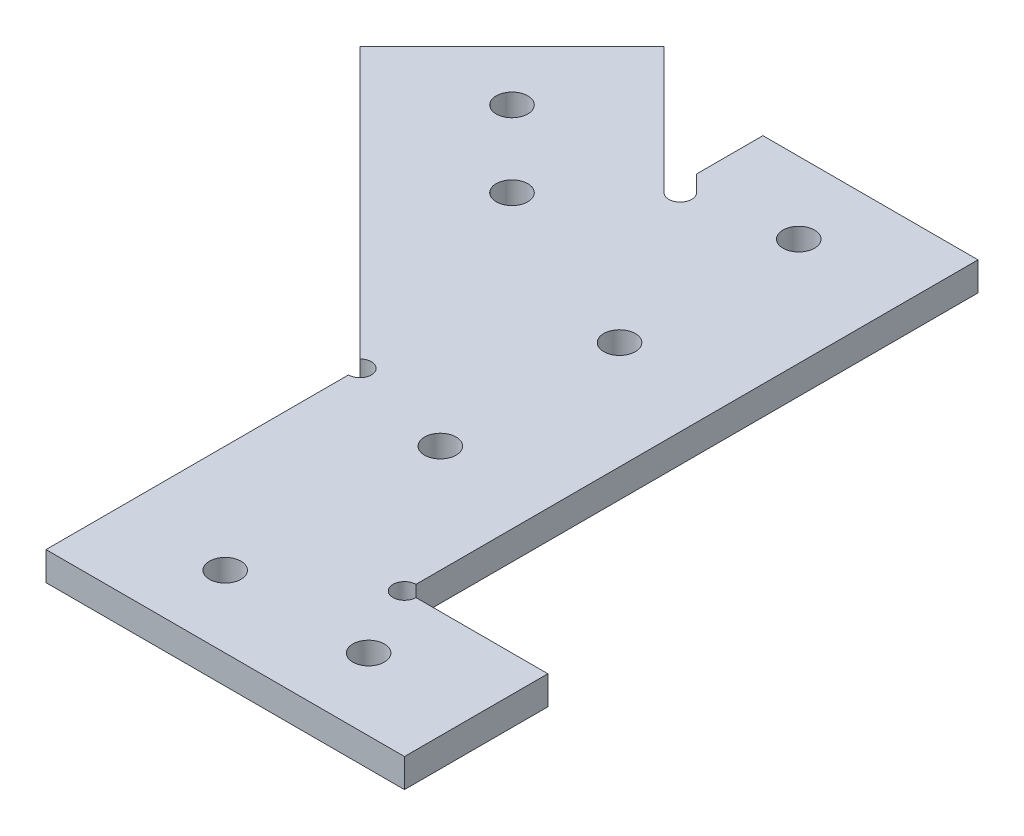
ISO-10303-21;
HEADER;
FILE_DESCRIPTION(('STEP AP214'),'2;1');
FILE_NAME('part.step','',(''),(''),'','','');
FILE_SCHEMA(('AUTOMOTIVE_DESIGN { 1 0 10303 214 1 1 1 1 }'));
ENDSEC;
DATA;
#1=APPLICATION_CONTEXT('core data for automotive mechanical design processes');
#2=APPLICATION_PROTOCOL_DEFINITION('international standard','automotive_design',2000,#1);
#3=PRODUCT_CONTEXT('',#1,'mechanical');
#4=PRODUCT('Part','Part','',(#3));
#5=PRODUCT_RELATED_PRODUCT_CATEGORY('part','',(#4));
#6=PRODUCT_DEFINITION_FORMATION('','',#4);
#7=PRODUCT_DEFINITION_CONTEXT('part definition',#1,'design');
#8=PRODUCT_DEFINITION('design','',#6,#7);
#9=PRODUCT_DEFINITION_SHAPE('','',#8);
#10=(LENGTH_UNIT() NAMED_UNIT(*) SI_UNIT(.MILLI.,.METRE.));
#11=(NAMED_UNIT(*) PLANE_ANGLE_UNIT() SI_UNIT($,.RADIAN.));
#12=(NAMED_UNIT(*) SI_UNIT($,.STERADIAN.) SOLID_ANGLE_UNIT());
#13=UNCERTAINTY_MEASURE_WITH_UNIT(LENGTH_MEASURE(1.E-05),#10,'distance_accuracy_value','');
#14=(GEOMETRIC_REPRESENTATION_CONTEXT(3) GLOBAL_UNCERTAINTY_ASSIGNED_CONTEXT((#13)) GLOBAL_UNIT_ASSIGNED_CONTEXT((#10,
#11,#12)) REPRESENTATION_CONTEXT('',''));
#15=CARTESIAN_POINT('',(0.,0.,0.));
#16=DIRECTION('',(0.,0.,1.));
#17=DIRECTION('',(1.,0.,0.));
#18=AXIS2_PLACEMENT_3D('',#15,#16,#17);
#19=CARTESIAN_POINT('',(35.3611682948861,0.,-35.3611682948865));
#20=DIRECTION('',(0.707106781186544,0.,-0.707106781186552));
#21=DIRECTION('',(0.,-1.,0.));
#22=AXIS2_PLACEMENT_3D('',#19,#20,#21);
#23=PLANE('',#22);
#24=DIRECTION('',(-0.707106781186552,0.,-0.707106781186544));
#25=VECTOR('',#24,1.);
#26=CARTESIAN_POINT('',(35.3611682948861,4.,-35.3611682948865));
#27=LINE('',#26,#25);
#28=CARTESIAN_POINT('',(2.11880443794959,4.,-68.6035321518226));
#29=VERTEX_POINT('',#28);
#30=CARTESIAN_POINT('',(0.,4.,-70.7223365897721));
#31=VERTEX_POINT('',#30);
#32=EDGE_CURVE('E142',#29,#31,#27,.T.);
#33=ORIENTED_EDGE('',*,*,#32,.T.);
#34=DIRECTION('',(0.,1.,0.));
#35=VECTOR('',#34,1.);
#36=CARTESIAN_POINT('',(0.,0.,-70.7223365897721));
#37=LINE('',#36,#35);
#38=CARTESIAN_POINT('',(0.,0.,-70.7223365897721));
#39=VERTEX_POINT('',#38);
#40=EDGE_CURVE('E184',#39,#31,#37,.T.);
#41=ORIENTED_EDGE('',*,*,#40,.F.);
#42=DIRECTION('',(-0.707106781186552,0.,-0.707106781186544));
#43=VECTOR('',#42,1.);
#44=CARTESIAN_POINT('',(35.3611682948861,0.,-35.3611682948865));
#45=LINE('',#44,#43);
#46=CARTESIAN_POINT('',(2.11880443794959,0.,-68.6035321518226));
#47=VERTEX_POINT('',#46);
#48=EDGE_CURVE('E11',#47,#39,#45,.T.);
#49=ORIENTED_EDGE('',*,*,#48,.F.);
#50=DIRECTION('',(0.,1.,0.));
#51=VECTOR('',#50,1.);
#52=CARTESIAN_POINT('',(2.11880443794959,0.,-68.6035321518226));
#53=LINE('',#52,#51);
#54=EDGE_CURVE('E338',#47,#29,#53,.T.);
#55=ORIENTED_EDGE('',*,*,#54,.T.);
#56=EDGE_LOOP('',(#33,#41,#49,#55));
#57=FACE_BOUND('',#56,.T.);
#58=ADVANCED_FACE('F17',(#57),#23,.F.);
#59=CARTESIAN_POINT('',(0.,0.,-23.7867965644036));
#60=DIRECTION('',(0.,1.,0.));
#61=DIRECTION('',(0.,0.,1.));
#62=AXIS2_PLACEMENT_3D('',#59,#60,#61);
#63=CYLINDRICAL_SURFACE('',#62,1.6);
#64=DIRECTION('',(0.,1.,0.));
#65=VECTOR('',#64,1.);
#66=CARTESIAN_POINT('',(0.,0.,-22.1867965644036));
#67=LINE('',#66,#65);
#68=CARTESIAN_POINT('',(0.,0.,-22.1867965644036));
#69=VERTEX_POINT('',#68);
#70=CARTESIAN_POINT('',(0.,4.,-22.1867965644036));
#71=VERTEX_POINT('',#70);
#72=EDGE_CURVE('E266',#69,#71,#67,.T.);
#73=ORIENTED_EDGE('',*,*,#72,.T.);
#74=CARTESIAN_POINT('',(0.,4.,-23.7867965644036));
#75=DIRECTION('',(0.,1.,0.));
#76=DIRECTION('',(0.,0.,1.));
#77=AXIS2_PLACEMENT_3D('',#74,#75,#76);
#78=CIRCLE('',#77,1.6);
#79=CARTESIAN_POINT('',(-1.13137084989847,4.,-24.918167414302));
#80=VERTEX_POINT('',#79);
#81=EDGE_CURVE('E39',#71,#80,#78,.T.);
#82=ORIENTED_EDGE('',*,*,#81,.T.);
#83=DIRECTION('',(0.,1.,0.));
#84=VECTOR('',#83,1.);
#85=CARTESIAN_POINT('',(-1.13137084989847,0.,-24.918167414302));
#86=LINE('',#85,#84);
#87=CARTESIAN_POINT('',(-1.13137084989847,0.,-24.918167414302));
#88=VERTEX_POINT('',#87);
#89=EDGE_CURVE('E139',#88,#80,#86,.T.);
#90=ORIENTED_EDGE('',*,*,#89,.F.);
#91=CARTESIAN_POINT('',(0.,0.,-23.7867965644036));
#92=DIRECTION('',(0.,1.,0.));
#93=DIRECTION('',(0.,0.,1.));
#94=AXIS2_PLACEMENT_3D('',#91,#92,#93);
#95=CIRCLE('',#94,1.6);
#96=EDGE_CURVE('E26',#69,#88,#95,.T.);
#97=ORIENTED_EDGE('',*,*,#96,.F.);
#98=EDGE_LOOP('',(#73,#82,#90,#97));
#99=FACE_BOUND('',#98,.T.);
#100=ADVANCED_FACE('F922',(#99),#63,.F.);
#101=CARTESIAN_POINT('',(0.,0.,0.));
#102=DIRECTION('',(0.,1.,0.));
#103=DIRECTION('',(1.,0.,0.));
#104=AXIS2_PLACEMENT_3D('',#101,#102,#103);
#105=PLANE('',#104);
#106=CARTESIAN_POINT('',(15.,0.,10.));
#107=DIRECTION('',(0.,1.,0.));
#108=DIRECTION('',(0.,0.,1.));
#109=AXIS2_PLACEMENT_3D('',#106,#107,#108);
#110=CIRCLE('',#109,2.2);
#111=CARTESIAN_POINT('',(15.,0.,12.2));
#112=VERTEX_POINT('',#111);
#113=EDGE_CURVE('E320',#112,#112,#110,.T.);
#114=ORIENTED_EDGE('',*,*,#113,.T.);
#115=EDGE_LOOP('',(#114));
#116=FACE_BOUND('',#115,.T.);
#117=CARTESIAN_POINT('',(35.,0.,10.));
#118=DIRECTION('',(0.,1.,0.));
#119=DIRECTION('',(0.,0.,1.));
#120=AXIS2_PLACEMENT_3D('',#117,#118,#119);
#121=CIRCLE('',#120,2.2);
#122=CARTESIAN_POINT('',(35.,0.,12.2));
#123=VERTEX_POINT('',#122);
#124=EDGE_CURVE('E262',#123,#123,#121,.T.);
#125=ORIENTED_EDGE('',*,*,#124,.T.);
#126=EDGE_LOOP('',(#125));
#127=FACE_BOUND('',#126,.T.);
#128=CARTESIAN_POINT('',(15.,0.,-70.));
#129=DIRECTION('',(0.,1.,0.));
#130=DIRECTION('',(0.,0.,1.));
#131=AXIS2_PLACEMENT_3D('',#128,#129,#130);
#132=CIRCLE('',#131,2.2);
#133=CARTESIAN_POINT('',(15.,0.,-67.8));
#134=VERTEX_POINT('',#133);
#135=EDGE_CURVE('E242',#134,#134,#132,.T.);
#136=ORIENTED_EDGE('',*,*,#135,.T.);
#137=EDGE_LOOP('',(#136));
#138=FACE_BOUND('',#137,.T.);
#139=CARTESIAN_POINT('',(15.,0.,-45.));
#140=DIRECTION('',(0.,1.,0.));
#141=DIRECTION('',(0.,0.,1.));
#142=AXIS2_PLACEMENT_3D('',#139,#140,#141);
#143=CIRCLE('',#142,2.2);
#144=CARTESIAN_POINT('',(15.,0.,-42.8));
#145=VERTEX_POINT('',#144);
#146=EDGE_CURVE('E234',#145,#145,#143,.T.);
#147=ORIENTED_EDGE('',*,*,#146,.T.);
#148=EDGE_LOOP('',(#147));
#149=FACE_BOUND('',#148,.T.);
#150=CARTESIAN_POINT('',(15.,0.,-20.));
#151=DIRECTION('',(0.,1.,0.));
#152=DIRECTION('',(0.,0.,1.));
#153=AXIS2_PLACEMENT_3D('',#150,#151,#152);
#154=CIRCLE('',#153,2.2);
#155=CARTESIAN_POINT('',(15.,0.,-17.8));
#156=VERTEX_POINT('',#155);
#157=EDGE_CURVE('E221',#156,#156,#154,.T.);
#158=ORIENTED_EDGE('',*,*,#157,.T.);
#159=EDGE_LOOP('',(#158));
#160=FACE_BOUND('',#159,.T.);
#161=CARTESIAN_POINT('',(-10.6066017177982,0.,-55.6066017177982));
#162=DIRECTION('',(0.,1.,0.));
#163=DIRECTION('',(0.,0.,1.));
#164=AXIS2_PLACEMENT_3D('',#161,#162,#163);
#165=CIRCLE('',#164,2.2);
#166=CARTESIAN_POINT('',(-10.6066017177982,0.,-53.4066017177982));
#167=VERTEX_POINT('',#166);
#168=EDGE_CURVE('E222',#167,#167,#165,.T.);
#169=ORIENTED_EDGE('',*,*,#168,.T.);
#170=EDGE_LOOP('',(#169));
#171=FACE_BOUND('',#170,.T.);
#172=CARTESIAN_POINT('',(-21.2132034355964,0.,-66.2132034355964));
#173=DIRECTION('',(0.,1.,0.));
#174=DIRECTION('',(0.,0.,1.));
#175=AXIS2_PLACEMENT_3D('',#172,#173,#174);
#176=CIRCLE('',#175,2.2);
#177=CARTESIAN_POINT('',(-21.2132034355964,0.,-64.0132034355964));
#178=VERTEX_POINT('',#177);
#179=EDGE_CURVE('E319',#178,#178,#176,.T.);
#180=ORIENTED_EDGE('',*,*,#179,.T.);
#181=EDGE_LOOP('',(#180));
#182=FACE_BOUND('',#181,.T.);
#183=DIRECTION('',(0.,0.,-1.));
#184=VECTOR('',#183,1.);
#185=CARTESIAN_POINT('',(30.,0.,0.));
#186=LINE('',#185,#184);
#187=CARTESIAN_POINT('',(30.,0.,-1.6));
#188=VERTEX_POINT('',#187);
#189=CARTESIAN_POINT('',(30.,0.,-80.));
#190=VERTEX_POINT('',#189);
#191=EDGE_CURVE('E291',#188,#190,#186,.T.);
#192=ORIENTED_EDGE('',*,*,#191,.F.);
#193=CARTESIAN_POINT('',(30.,0.,0.));
#194=DIRECTION('',(0.,1.,0.));
#195=DIRECTION('',(0.,0.,1.));
#196=AXIS2_PLACEMENT_3D('',#193,#194,#195);
#197=CIRCLE('',#196,1.6);
#198=CARTESIAN_POINT('',(31.6,0.,0.));
#199=VERTEX_POINT('',#198);
#200=EDGE_CURVE('E361',#188,#199,#197,.T.);
#201=ORIENTED_EDGE('',*,*,#200,.T.);
#202=DIRECTION('',(-1.,0.,0.));
#203=VECTOR('',#202,1.);
#204=CARTESIAN_POINT('',(0.,0.,0.));
#205=LINE('',#204,#203);
#206=CARTESIAN_POINT('',(50.,0.,0.));
#207=VERTEX_POINT('',#206);
#208=EDGE_CURVE('E284',#207,#199,#205,.T.);
#209=ORIENTED_EDGE('',*,*,#208,.F.);
#210=DIRECTION('',(0.,0.,-1.));
#211=VECTOR('',#210,1.);
#212=CARTESIAN_POINT('',(50.,0.,0.));
#213=LINE('',#212,#211);
#214=CARTESIAN_POINT('',(50.,0.,20.));
#215=VERTEX_POINT('',#214);
#216=EDGE_CURVE('E272',#215,#207,#213,.T.);
#217=ORIENTED_EDGE('',*,*,#216,.F.);
#218=DIRECTION('',(1.,0.,0.));
#219=VECTOR('',#218,1.);
#220=CARTESIAN_POINT('',(0.,0.,20.));
#221=LINE('',#220,#219);
#222=CARTESIAN_POINT('',(0.,0.,20.));
#223=VERTEX_POINT('',#222);
#224=EDGE_CURVE('E252',#223,#215,#221,.T.);
#225=ORIENTED_EDGE('',*,*,#224,.F.);
#226=DIRECTION('',(0.,0.,-1.));
#227=VECTOR('',#226,1.);
#228=CARTESIAN_POINT('',(0.,0.,0.));
#229=LINE('',#228,#227);
#230=EDGE_CURVE('E258',#223,#69,#229,.T.);
#231=ORIENTED_EDGE('',*,*,#230,.T.);
#232=ORIENTED_EDGE('',*,*,#96,.T.);
#233=DIRECTION('',(0.707106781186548,0.,0.707106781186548));
#234=VECTOR('',#233,1.);
#235=CARTESIAN_POINT('',(11.8933982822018,0.,-11.8933982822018));
#236=LINE('',#235,#234);
#237=CARTESIAN_POINT('',(-38.8908729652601,0.,-62.6776695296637));
#238=VERTEX_POINT('',#237);
#239=EDGE_CURVE('E154',#238,#88,#236,.T.);
#240=ORIENTED_EDGE('',*,*,#239,.F.);
#241=DIRECTION('',(-0.707106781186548,0.,0.707106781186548));
#242=VECTOR('',#241,1.);
#243=CARTESIAN_POINT('',(-50.7842712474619,0.,-50.7842712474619));
#244=LINE('',#243,#242);
#245=CARTESIAN_POINT('',(-17.6776695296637,0.,-83.8908729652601));
#246=VERTEX_POINT('',#245);
#247=EDGE_CURVE('E157',#246,#238,#244,.T.);
#248=ORIENTED_EDGE('',*,*,#247,.F.);
#249=DIRECTION('',(-0.707106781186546,0.,-0.707106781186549));
#250=VECTOR('',#249,1.);
#251=CARTESIAN_POINT('',(33.1066017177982,0.,-33.106601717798));
#252=LINE('',#251,#250);
#253=CARTESIAN_POINT('',(0.,0.,-66.2132034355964));
#254=VERTEX_POINT('',#253);
#255=EDGE_CURVE('E191',#254,#246,#252,.T.);
#256=ORIENTED_EDGE('',*,*,#255,.F.);
#257=CARTESIAN_POINT('',(1.13137084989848,0.,-67.3445742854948));
#258=DIRECTION('',(0.,1.,0.));
#259=DIRECTION('',(0.,0.,1.));
#260=AXIS2_PLACEMENT_3D('',#257,#258,#259);
#261=CIRCLE('',#260,1.6);
#262=EDGE_CURVE('E352',#254,#47,#261,.T.);
#263=ORIENTED_EDGE('',*,*,#262,.T.);
#264=ORIENTED_EDGE('',*,*,#48,.T.);
#265=DIRECTION('',(0.,0.,-1.));
#266=VECTOR('',#265,1.);
#267=CARTESIAN_POINT('',(0.,0.,0.));
#268=LINE('',#267,#266);
#269=CARTESIAN_POINT('',(0.,0.,-80.));
#270=VERTEX_POINT('',#269);
#271=EDGE_CURVE('E188',#39,#270,#268,.T.);
#272=ORIENTED_EDGE('',*,*,#271,.T.);
#273=DIRECTION('',(1.,0.,0.));
#274=VECTOR('',#273,1.);
#275=CARTESIAN_POINT('',(0.,0.,-80.));
#276=LINE('',#275,#274);
#277=EDGE_CURVE('E170',#270,#190,#276,.T.);
#278=ORIENTED_EDGE('',*,*,#277,.T.);
#279=EDGE_LOOP('',(#192,#201,#209,#217,#225,#231,#232,#240,#248,#256,#263,#264,#272,#278));
#280=FACE_BOUND('',#279,.T.);
#281=ADVANCED_FACE('F385',(#116,#127,#138,#149,#160,#171,#182,#280),#105,.F.);
#282=CARTESIAN_POINT('',(0.,4.,0.));
#283=DIRECTION('',(0.,1.,0.));
#284=DIRECTION('',(1.,0.,0.));
#285=AXIS2_PLACEMENT_3D('',#282,#283,#284);
#286=PLANE('',#285);
#287=CARTESIAN_POINT('',(15.,4.,10.));
#288=DIRECTION('',(0.,1.,0.));
#289=DIRECTION('',(0.,0.,1.));
#290=AXIS2_PLACEMENT_3D('',#287,#288,#289);
#291=CIRCLE('',#290,2.2);
#292=CARTESIAN_POINT('',(15.,4.,12.2));
#293=VERTEX_POINT('',#292);
#294=EDGE_CURVE('E330',#293,#293,#291,.T.);
#295=ORIENTED_EDGE('',*,*,#294,.F.);
#296=EDGE_LOOP('',(#295));
#297=FACE_BOUND('',#296,.T.);
#298=CARTESIAN_POINT('',(35.,4.,10.));
#299=DIRECTION('',(0.,1.,0.));
#300=DIRECTION('',(0.,0.,1.));
#301=AXIS2_PLACEMENT_3D('',#298,#299,#300);
#302=CIRCLE('',#301,2.2);
#303=CARTESIAN_POINT('',(35.,4.,12.2));
#304=VERTEX_POINT('',#303);
#305=EDGE_CURVE('E246',#304,#304,#302,.T.);
#306=ORIENTED_EDGE('',*,*,#305,.F.);
#307=EDGE_LOOP('',(#306));
#308=FACE_BOUND('',#307,.T.);
#309=CARTESIAN_POINT('',(15.,4.,-70.));
#310=DIRECTION('',(0.,1.,0.));
#311=DIRECTION('',(0.,0.,1.));
#312=AXIS2_PLACEMENT_3D('',#309,#310,#311);
#313=CIRCLE('',#312,2.2);
#314=CARTESIAN_POINT('',(15.,4.,-67.8));
#315=VERTEX_POINT('',#314);
#316=EDGE_CURVE('E238',#315,#315,#313,.T.);
#317=ORIENTED_EDGE('',*,*,#316,.F.);
#318=EDGE_LOOP('',(#317));
#319=FACE_BOUND('',#318,.T.);
#320=CARTESIAN_POINT('',(15.,4.,-45.));
#321=DIRECTION('',(0.,1.,0.));
#322=DIRECTION('',(0.,0.,1.));
#323=AXIS2_PLACEMENT_3D('',#320,#321,#322);
#324=CIRCLE('',#323,2.2);
#325=CARTESIAN_POINT('',(15.,4.,-42.8));
#326=VERTEX_POINT('',#325);
#327=EDGE_CURVE('E228',#326,#326,#324,.T.);
#328=ORIENTED_EDGE('',*,*,#327,.F.);
#329=EDGE_LOOP('',(#328));
#330=FACE_BOUND('',#329,.T.);
#331=CARTESIAN_POINT('',(15.,4.,-20.));
#332=DIRECTION('',(0.,1.,0.));
#333=DIRECTION('',(0.,0.,1.));
#334=AXIS2_PLACEMENT_3D('',#331,#332,#333);
#335=CIRCLE('',#334,2.2);
#336=CARTESIAN_POINT('',(15.,4.,-17.8));
#337=VERTEX_POINT('',#336);
#338=EDGE_CURVE('E217',#337,#337,#335,.T.);
#339=ORIENTED_EDGE('',*,*,#338,.F.);
#340=EDGE_LOOP('',(#339));
#341=FACE_BOUND('',#340,.T.);
#342=CARTESIAN_POINT('',(-10.6066017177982,4.,-55.6066017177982));
#343=DIRECTION('',(0.,1.,0.));
#344=DIRECTION('',(0.,0.,1.));
#345=AXIS2_PLACEMENT_3D('',#342,#343,#344);
#346=CIRCLE('',#345,2.2);
#347=CARTESIAN_POINT('',(-10.6066017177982,4.,-53.4066017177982));
#348=VERTEX_POINT('',#347);
#349=EDGE_CURVE('E215',#348,#348,#346,.T.);
#350=ORIENTED_EDGE('',*,*,#349,.F.);
#351=EDGE_LOOP('',(#350));
#352=FACE_BOUND('',#351,.T.);
#353=CARTESIAN_POINT('',(-21.2132034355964,4.,-66.2132034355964));
#354=DIRECTION('',(0.,1.,0.));
#355=DIRECTION('',(0.,0.,1.));
#356=AXIS2_PLACEMENT_3D('',#353,#354,#355);
#357=CIRCLE('',#356,2.2);
#358=CARTESIAN_POINT('',(-21.2132034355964,4.,-64.0132034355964));
#359=VERTEX_POINT('',#358);
#360=EDGE_CURVE('E316',#359,#359,#357,.T.);
#361=ORIENTED_EDGE('',*,*,#360,.F.);
#362=EDGE_LOOP('',(#361));
#363=FACE_BOUND('',#362,.T.);
#364=CARTESIAN_POINT('',(30.,4.,0.));
#365=DIRECTION('',(0.,1.,0.));
#366=DIRECTION('',(0.,0.,1.));
#367=AXIS2_PLACEMENT_3D('',#364,#365,#366);
#368=CIRCLE('',#367,1.6);
#369=CARTESIAN_POINT('',(30.,4.,-1.6));
#370=VERTEX_POINT('',#369);
#371=CARTESIAN_POINT('',(31.6,4.,0.));
#372=VERTEX_POINT('',#371);
#373=EDGE_CURVE('E370',#370,#372,#368,.T.);
#374=ORIENTED_EDGE('',*,*,#373,.F.);
#375=DIRECTION('',(0.,0.,-1.));
#376=VECTOR('',#375,1.);
#377=CARTESIAN_POINT('',(30.,4.,0.));
#378=LINE('',#377,#376);
#379=CARTESIAN_POINT('',(30.,4.,-80.));
#380=VERTEX_POINT('',#379);
#381=EDGE_CURVE('E294',#370,#380,#378,.T.);
#382=ORIENTED_EDGE('',*,*,#381,.T.);
#383=DIRECTION('',(1.,0.,0.));
#384=VECTOR('',#383,1.);
#385=CARTESIAN_POINT('',(0.,4.,-80.));
#386=LINE('',#385,#384);
#387=CARTESIAN_POINT('',(0.,4.,-80.));
#388=VERTEX_POINT('',#387);
#389=EDGE_CURVE('E178',#388,#380,#386,.T.);
#390=ORIENTED_EDGE('',*,*,#389,.F.);
#391=DIRECTION('',(0.,0.,-1.));
#392=VECTOR('',#391,1.);
#393=CARTESIAN_POINT('',(0.,4.,0.));
#394=LINE('',#393,#392);
#395=EDGE_CURVE('E185',#31,#388,#394,.T.);
#396=ORIENTED_EDGE('',*,*,#395,.F.);
#397=ORIENTED_EDGE('',*,*,#32,.F.);
#398=CARTESIAN_POINT('',(1.13137084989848,4.,-67.3445742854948));
#399=DIRECTION('',(0.,1.,0.));
#400=DIRECTION('',(0.,0.,1.));
#401=AXIS2_PLACEMENT_3D('',#398,#399,#400);
#402=CIRCLE('',#401,1.6);
#403=CARTESIAN_POINT('',(0.,4.,-66.2132034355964));
#404=VERTEX_POINT('',#403);
#405=EDGE_CURVE('E343',#404,#29,#402,.T.);
#406=ORIENTED_EDGE('',*,*,#405,.F.);
#407=DIRECTION('',(-0.707106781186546,0.,-0.707106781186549));
#408=VECTOR('',#407,1.);
#409=CARTESIAN_POINT('',(33.1066017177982,4.,-33.106601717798));
#410=LINE('',#409,#408);
#411=CARTESIAN_POINT('',(-17.6776695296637,4.,-83.8908729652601));
#412=VERTEX_POINT('',#411);
#413=EDGE_CURVE('E149',#404,#412,#410,.T.);
#414=ORIENTED_EDGE('',*,*,#413,.T.);
#415=DIRECTION('',(-0.707106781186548,0.,0.707106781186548));
#416=VECTOR('',#415,1.);
#417=CARTESIAN_POINT('',(-50.7842712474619,4.,-50.7842712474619));
#418=LINE('',#417,#416);
#419=CARTESIAN_POINT('',(-38.8908729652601,4.,-62.6776695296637));
#420=VERTEX_POINT('',#419);
#421=EDGE_CURVE('E146',#412,#420,#418,.T.);
#422=ORIENTED_EDGE('',*,*,#421,.T.);
#423=DIRECTION('',(0.707106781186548,0.,0.707106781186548));
#424=VECTOR('',#423,1.);
#425=CARTESIAN_POINT('',(11.8933982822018,4.,-11.8933982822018));
#426=LINE('',#425,#424);
#427=EDGE_CURVE('E132',#420,#80,#426,.T.);
#428=ORIENTED_EDGE('',*,*,#427,.T.);
#429=ORIENTED_EDGE('',*,*,#81,.F.);
#430=DIRECTION('',(0.,0.,-1.));
#431=VECTOR('',#430,1.);
#432=CARTESIAN_POINT('',(0.,4.,0.));
#433=LINE('',#432,#431);
#434=CARTESIAN_POINT('',(0.,4.,20.));
#435=VERTEX_POINT('',#434);
#436=EDGE_CURVE('E257',#435,#71,#433,.T.);
#437=ORIENTED_EDGE('',*,*,#436,.F.);
#438=DIRECTION('',(1.,0.,0.));
#439=VECTOR('',#438,1.);
#440=CARTESIAN_POINT('',(0.,4.,20.));
#441=LINE('',#440,#439);
#442=CARTESIAN_POINT('',(50.,4.,20.));
#443=VERTEX_POINT('',#442);
#444=EDGE_CURVE('E251',#435,#443,#441,.T.);
#445=ORIENTED_EDGE('',*,*,#444,.T.);
#446=DIRECTION('',(0.,0.,-1.));
#447=VECTOR('',#446,1.);
#448=CARTESIAN_POINT('',(50.,4.,0.));
#449=LINE('',#448,#447);
#450=CARTESIAN_POINT('',(50.,4.,0.));
#451=VERTEX_POINT('',#450);
#452=EDGE_CURVE('E280',#443,#451,#449,.T.);
#453=ORIENTED_EDGE('',*,*,#452,.T.);
#454=DIRECTION('',(-1.,0.,0.));
#455=VECTOR('',#454,1.);
#456=CARTESIAN_POINT('',(0.,4.,0.));
#457=LINE('',#456,#455);
#458=EDGE_CURVE('E288',#451,#372,#457,.T.);
#459=ORIENTED_EDGE('',*,*,#458,.T.);
#460=EDGE_LOOP('',(#374,#382,#390,#396,#397,#406,#414,#422,#428,#429,#437,#445,#453,#459));
#461=FACE_BOUND('',#460,.T.);
#462=ADVANCED_FACE('F147',(#297,#308,#319,#330,#341,#352,#363,#461),#286,.T.);
#463=CARTESIAN_POINT('',(11.8933982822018,4.,-11.8933982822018));
#464=DIRECTION('',(0.707106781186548,0.,-0.707106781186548));
#465=DIRECTION('',(0.,-1.,0.));
#466=AXIS2_PLACEMENT_3D('',#463,#464,#465);
#467=PLANE('',#466);
#468=ORIENTED_EDGE('',*,*,#239,.T.);
#469=ORIENTED_EDGE('',*,*,#89,.T.);
#470=ORIENTED_EDGE('',*,*,#427,.F.);
#471=DIRECTION('',(0.,-1.,0.));
#472=VECTOR('',#471,1.);
#473=CARTESIAN_POINT('',(-38.8908729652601,4.,-62.6776695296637));
#474=LINE('',#473,#472);
#475=EDGE_CURVE('E137',#420,#238,#474,.T.);
#476=ORIENTED_EDGE('',*,*,#475,.T.);
#477=EDGE_LOOP('',(#468,#469,#470,#476));
#478=FACE_BOUND('',#477,.T.);
#479=ADVANCED_FACE('F135',(#478),#467,.F.);
#480=CARTESIAN_POINT('',(-50.7842712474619,4.,-50.7842712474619));
#481=DIRECTION('',(0.707106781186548,0.,0.707106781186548));
#482=DIRECTION('',(0.,-1.,0.));
#483=AXIS2_PLACEMENT_3D('',#480,#481,#482);
#484=PLANE('',#483);
#485=ORIENTED_EDGE('',*,*,#247,.T.);
#486=ORIENTED_EDGE('',*,*,#475,.F.);
#487=ORIENTED_EDGE('',*,*,#421,.F.);
#488=DIRECTION('',(0.,-1.,0.));
#489=VECTOR('',#488,1.);
#490=CARTESIAN_POINT('',(-17.6776695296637,4.,-83.8908729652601));
#491=LINE('',#490,#489);
#492=EDGE_CURVE('E181',#412,#246,#491,.T.);
#493=ORIENTED_EDGE('',*,*,#492,.T.);
#494=EDGE_LOOP('',(#485,#486,#487,#493));
#495=FACE_BOUND('',#494,.T.);
#496=ADVANCED_FACE('F156',(#495),#484,.F.);
#497=CARTESIAN_POINT('',(33.1066017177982,4.,-33.106601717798));
#498=DIRECTION('',(-0.707106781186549,0.,0.707106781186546));
#499=DIRECTION('',(0.,1.,0.));
#500=AXIS2_PLACEMENT_3D('',#497,#498,#499);
#501=PLANE('',#500);
#502=ORIENTED_EDGE('',*,*,#255,.T.);
#503=ORIENTED_EDGE('',*,*,#492,.F.);
#504=ORIENTED_EDGE('',*,*,#413,.F.);
#505=DIRECTION('',(0.,-1.,0.));
#506=VECTOR('',#505,1.);
#507=CARTESIAN_POINT('',(0.,4.,-66.2132034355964));
#508=LINE('',#507,#506);
#509=EDGE_CURVE('E164',#404,#254,#508,.T.);
#510=ORIENTED_EDGE('',*,*,#509,.T.);
#511=EDGE_LOOP('',(#502,#503,#504,#510));
#512=FACE_BOUND('',#511,.T.);
#513=ADVANCED_FACE('F411',(#512),#501,.F.);
#514=CARTESIAN_POINT('',(0.,4.,0.));
#515=DIRECTION('',(-1.,0.,0.));
#516=DIRECTION('',(0.,0.,1.));
#517=AXIS2_PLACEMENT_3D('',#514,#515,#516);
#518=PLANE('',#517);
#519=ORIENTED_EDGE('',*,*,#40,.T.);
#520=ORIENTED_EDGE('',*,*,#395,.T.);
#521=DIRECTION('',(0.,-1.,0.));
#522=VECTOR('',#521,1.);
#523=CARTESIAN_POINT('',(0.,4.,-80.));
#524=LINE('',#523,#522);
#525=EDGE_CURVE('E173',#388,#270,#524,.T.);
#526=ORIENTED_EDGE('',*,*,#525,.T.);
#527=ORIENTED_EDGE('',*,*,#271,.F.);
#528=EDGE_LOOP('',(#519,#520,#526,#527));
#529=FACE_BOUND('',#528,.T.);
#530=ADVANCED_FACE('F407',(#529),#518,.T.);
#531=CARTESIAN_POINT('',(0.,4.,-80.));
#532=DIRECTION('',(0.,0.,-1.));
#533=DIRECTION('',(0.,-1.,0.));
#534=AXIS2_PLACEMENT_3D('',#531,#532,#533);
#535=PLANE('',#534);
#536=ORIENTED_EDGE('',*,*,#277,.F.);
#537=ORIENTED_EDGE('',*,*,#525,.F.);
#538=ORIENTED_EDGE('',*,*,#389,.T.);
#539=DIRECTION('',(0.,-1.,0.));
#540=VECTOR('',#539,1.);
#541=CARTESIAN_POINT('',(30.,4.,-80.));
#542=LINE('',#541,#540);
#543=EDGE_CURVE('E174',#380,#190,#542,.T.);
#544=ORIENTED_EDGE('',*,*,#543,.T.);
#545=EDGE_LOOP('',(#536,#537,#538,#544));
#546=FACE_BOUND('',#545,.T.);
#547=ADVANCED_FACE('F851',(#546),#535,.T.);
#548=CARTESIAN_POINT('',(30.,4.,0.));
#549=DIRECTION('',(-1.,0.,0.));
#550=DIRECTION('',(0.,0.,1.));
#551=AXIS2_PLACEMENT_3D('',#548,#549,#550);
#552=PLANE('',#551);
#553=ORIENTED_EDGE('',*,*,#381,.F.);
#554=DIRECTION('',(0.,1.,0.));
#555=VECTOR('',#554,1.);
#556=CARTESIAN_POINT('',(30.,0.,-1.6));
#557=LINE('',#556,#555);
#558=EDGE_CURVE('E168',#188,#370,#557,.T.);
#559=ORIENTED_EDGE('',*,*,#558,.F.);
#560=ORIENTED_EDGE('',*,*,#191,.T.);
#561=ORIENTED_EDGE('',*,*,#543,.F.);
#562=EDGE_LOOP('',(#553,#559,#560,#561));
#563=FACE_BOUND('',#562,.T.);
#564=ADVANCED_FACE('F933',(#563),#552,.F.);
#565=CARTESIAN_POINT('',(0.,4.,0.));
#566=DIRECTION('',(0.,0.,1.));
#567=DIRECTION('',(1.,0.,0.));
#568=AXIS2_PLACEMENT_3D('',#565,#566,#567);
#569=PLANE('',#568);
#570=ORIENTED_EDGE('',*,*,#208,.T.);
#571=DIRECTION('',(0.,1.,0.));
#572=VECTOR('',#571,1.);
#573=CARTESIAN_POINT('',(31.6,0.,0.));
#574=LINE('',#573,#572);
#575=EDGE_CURVE('E341',#199,#372,#574,.T.);
#576=ORIENTED_EDGE('',*,*,#575,.T.);
#577=ORIENTED_EDGE('',*,*,#458,.F.);
#578=DIRECTION('',(0.,-1.,0.));
#579=VECTOR('',#578,1.);
#580=CARTESIAN_POINT('',(50.,4.,0.));
#581=LINE('',#580,#579);
#582=EDGE_CURVE('E279',#451,#207,#581,.T.);
#583=ORIENTED_EDGE('',*,*,#582,.T.);
#584=EDGE_LOOP('',(#570,#576,#577,#583));
#585=FACE_BOUND('',#584,.T.);
#586=ADVANCED_FACE('F393',(#585),#569,.F.);
#587=CARTESIAN_POINT('',(50.,4.,0.));
#588=DIRECTION('',(-1.,0.,0.));
#589=DIRECTION('',(0.,0.,1.));
#590=AXIS2_PLACEMENT_3D('',#587,#588,#589);
#591=PLANE('',#590);
#592=ORIENTED_EDGE('',*,*,#216,.T.);
#593=ORIENTED_EDGE('',*,*,#582,.F.);
#594=ORIENTED_EDGE('',*,*,#452,.F.);
#595=DIRECTION('',(0.,-1.,0.));
#596=VECTOR('',#595,1.);
#597=CARTESIAN_POINT('',(50.,4.,20.));
#598=LINE('',#597,#596);
#599=EDGE_CURVE('E247',#443,#215,#598,.T.);
#600=ORIENTED_EDGE('',*,*,#599,.T.);
#601=EDGE_LOOP('',(#592,#593,#594,#600));
#602=FACE_BOUND('',#601,.T.);
#603=ADVANCED_FACE('F896',(#602),#591,.F.);
#604=CARTESIAN_POINT('',(0.,4.,20.));
#605=DIRECTION('',(0.,0.,-1.));
#606=DIRECTION('',(0.,-1.,0.));
#607=AXIS2_PLACEMENT_3D('',#604,#605,#606);
#608=PLANE('',#607);
#609=ORIENTED_EDGE('',*,*,#224,.T.);
#610=ORIENTED_EDGE('',*,*,#599,.F.);
#611=ORIENTED_EDGE('',*,*,#444,.F.);
#612=DIRECTION('',(0.,-1.,0.));
#613=VECTOR('',#612,1.);
#614=CARTESIAN_POINT('',(0.,4.,20.));
#615=LINE('',#614,#613);
#616=EDGE_CURVE('E253',#435,#223,#615,.T.);
#617=ORIENTED_EDGE('',*,*,#616,.T.);
#618=EDGE_LOOP('',(#609,#610,#611,#617));
#619=FACE_BOUND('',#618,.T.);
#620=ADVANCED_FACE('F874',(#619),#608,.F.);
#621=CARTESIAN_POINT('',(0.,4.,0.));
#622=DIRECTION('',(-1.,0.,0.));
#623=DIRECTION('',(0.,0.,1.));
#624=AXIS2_PLACEMENT_3D('',#621,#622,#623);
#625=PLANE('',#624);
#626=ORIENTED_EDGE('',*,*,#72,.F.);
#627=ORIENTED_EDGE('',*,*,#230,.F.);
#628=ORIENTED_EDGE('',*,*,#616,.F.);
#629=ORIENTED_EDGE('',*,*,#436,.T.);
#630=EDGE_LOOP('',(#626,#627,#628,#629));
#631=FACE_BOUND('',#630,.T.);
#632=ADVANCED_FACE('F513',(#631),#625,.T.);
#633=CARTESIAN_POINT('',(35.,4.,10.));
#634=DIRECTION('',(0.,-1.,0.));
#635=DIRECTION('',(0.,0.,-1.));
#636=AXIS2_PLACEMENT_3D('',#633,#634,#635);
#637=CYLINDRICAL_SURFACE('',#636,2.2);
#638=ORIENTED_EDGE('',*,*,#124,.F.);
#639=EDGE_LOOP('',(#638));
#640=FACE_BOUND('',#639,.T.);
#641=ORIENTED_EDGE('',*,*,#305,.T.);
#642=EDGE_LOOP('',(#641));
#643=FACE_BOUND('',#642,.T.);
#644=ADVANCED_FACE('F506',(#640,#643),#637,.F.);
#645=CARTESIAN_POINT('',(15.,4.,-70.));
#646=DIRECTION('',(0.,-1.,0.));
#647=DIRECTION('',(0.,0.,-1.));
#648=AXIS2_PLACEMENT_3D('',#645,#646,#647);
#649=CYLINDRICAL_SURFACE('',#648,2.2);
#650=ORIENTED_EDGE('',*,*,#135,.F.);
#651=EDGE_LOOP('',(#650));
#652=FACE_BOUND('',#651,.T.);
#653=ORIENTED_EDGE('',*,*,#316,.T.);
#654=EDGE_LOOP('',(#653));
#655=FACE_BOUND('',#654,.T.);
#656=ADVANCED_FACE('F512',(#652,#655),#649,.F.);
#657=CARTESIAN_POINT('',(15.,4.,-45.));
#658=DIRECTION('',(0.,-1.,0.));
#659=DIRECTION('',(0.,0.,-1.));
#660=AXIS2_PLACEMENT_3D('',#657,#658,#659);
#661=CYLINDRICAL_SURFACE('',#660,2.2);
#662=ORIENTED_EDGE('',*,*,#146,.F.);
#663=EDGE_LOOP('',(#662));
#664=FACE_BOUND('',#663,.T.);
#665=ORIENTED_EDGE('',*,*,#327,.T.);
#666=EDGE_LOOP('',(#665));
#667=FACE_BOUND('',#666,.T.);
#668=ADVANCED_FACE('F528',(#664,#667),#661,.F.);
#669=CARTESIAN_POINT('',(15.,4.,-20.));
#670=DIRECTION('',(0.,-1.,0.));
#671=DIRECTION('',(0.,0.,-1.));
#672=AXIS2_PLACEMENT_3D('',#669,#670,#671);
#673=CYLINDRICAL_SURFACE('',#672,2.2);
#674=ORIENTED_EDGE('',*,*,#157,.F.);
#675=EDGE_LOOP('',(#674));
#676=FACE_BOUND('',#675,.T.);
#677=ORIENTED_EDGE('',*,*,#338,.T.);
#678=EDGE_LOOP('',(#677));
#679=FACE_BOUND('',#678,.T.);
#680=ADVANCED_FACE('F540',(#676,#679),#673,.F.);
#681=CARTESIAN_POINT('',(-10.6066017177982,4.,-55.6066017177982));
#682=DIRECTION('',(0.,-1.,0.));
#683=DIRECTION('',(0.,0.,-1.));
#684=AXIS2_PLACEMENT_3D('',#681,#682,#683);
#685=CYLINDRICAL_SURFACE('',#684,2.2);
#686=ORIENTED_EDGE('',*,*,#168,.F.);
#687=EDGE_LOOP('',(#686));
#688=FACE_BOUND('',#687,.T.);
#689=ORIENTED_EDGE('',*,*,#349,.T.);
#690=EDGE_LOOP('',(#689));
#691=FACE_BOUND('',#690,.T.);
#692=ADVANCED_FACE('F552',(#688,#691),#685,.F.);
#693=CARTESIAN_POINT('',(-21.2132034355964,4.,-66.2132034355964));
#694=DIRECTION('',(0.,-1.,0.));
#695=DIRECTION('',(0.,0.,-1.));
#696=AXIS2_PLACEMENT_3D('',#693,#694,#695);
#697=CYLINDRICAL_SURFACE('',#696,2.2);
#698=ORIENTED_EDGE('',*,*,#179,.F.);
#699=EDGE_LOOP('',(#698));
#700=FACE_BOUND('',#699,.T.);
#701=ORIENTED_EDGE('',*,*,#360,.T.);
#702=EDGE_LOOP('',(#701));
#703=FACE_BOUND('',#702,.T.);
#704=ADVANCED_FACE('F564',(#700,#703),#697,.F.);
#705=CARTESIAN_POINT('',(15.,4.,10.));
#706=DIRECTION('',(0.,-1.,0.));
#707=DIRECTION('',(0.,0.,-1.));
#708=AXIS2_PLACEMENT_3D('',#705,#706,#707);
#709=CYLINDRICAL_SURFACE('',#708,2.2);
#710=ORIENTED_EDGE('',*,*,#113,.F.);
#711=EDGE_LOOP('',(#710));
#712=FACE_BOUND('',#711,.T.);
#713=ORIENTED_EDGE('',*,*,#294,.T.);
#714=EDGE_LOOP('',(#713));
#715=FACE_BOUND('',#714,.T.);
#716=ADVANCED_FACE('F576',(#712,#715),#709,.F.);
#717=CARTESIAN_POINT('',(1.13137084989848,0.,-67.3445742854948));
#718=DIRECTION('',(0.,1.,0.));
#719=DIRECTION('',(0.,0.,1.));
#720=AXIS2_PLACEMENT_3D('',#717,#718,#719);
#721=CYLINDRICAL_SURFACE('',#720,1.6);
#722=ORIENTED_EDGE('',*,*,#262,.F.);
#723=ORIENTED_EDGE('',*,*,#509,.F.);
#724=ORIENTED_EDGE('',*,*,#405,.T.);
#725=ORIENTED_EDGE('',*,*,#54,.F.);
#726=EDGE_LOOP('',(#722,#723,#724,#725));
#727=FACE_BOUND('',#726,.T.);
#728=ADVANCED_FACE('F408',(#727),#721,.F.);
#729=CARTESIAN_POINT('',(30.,0.,0.));
#730=DIRECTION('',(0.,1.,0.));
#731=DIRECTION('',(0.,0.,1.));
#732=AXIS2_PLACEMENT_3D('',#729,#730,#731);
#733=CYLINDRICAL_SURFACE('',#732,1.6);
#734=ORIENTED_EDGE('',*,*,#200,.F.);
#735=ORIENTED_EDGE('',*,*,#558,.T.);
#736=ORIENTED_EDGE('',*,*,#373,.T.);
#737=ORIENTED_EDGE('',*,*,#575,.F.);
#738=EDGE_LOOP('',(#734,#735,#736,#737));
#739=FACE_BOUND('',#738,.T.);
#740=ADVANCED_FACE('F391',(#739),#733,.F.);
#741=CLOSED_SHELL('',(#58,#100,#281,#462,#479,#496,#513,#530,#547,#564,#586,#603,#620,#632,#644,
#656,#668,#680,#692,#704,#716,#728,#740));
#742=MANIFOLD_SOLID_BREP('B1',#741);
#743=ADVANCED_BREP_SHAPE_REPRESENTATION('',(#18,#742),#14);
#744=SHAPE_DEFINITION_REPRESENTATION(#9,#743);
ENDSEC;
END-ISO-10303-21;
